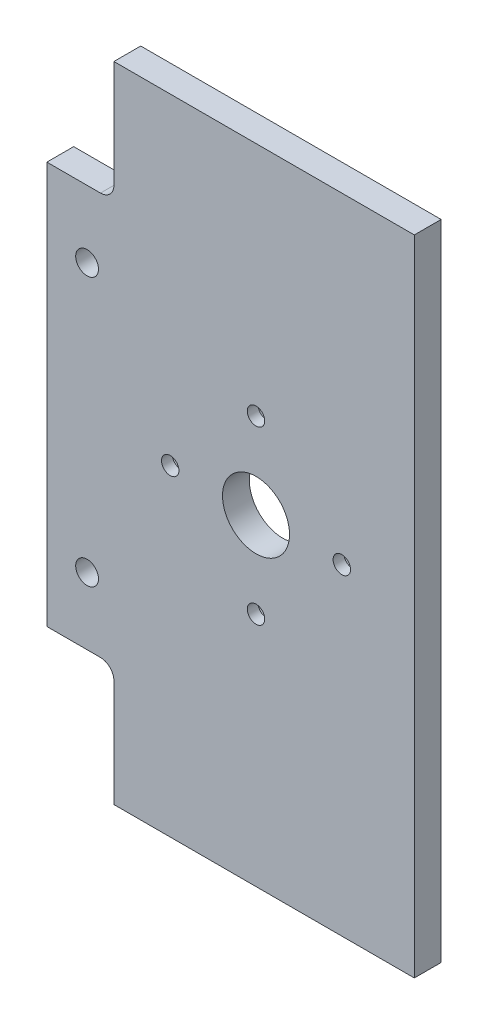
from build123d import *

# Parameters (mm, degrees)
ESQUISSE1_R                  = 12.5
ESQUISSE1_R_2                = 4
BASE_EXTRUSION_DEPTH         = 10
ESQUISSE2_R                  = 3.25
ENL_V_MAT_EXTRU_1_DEPTH      = 144.471251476
ESQUISSE3_R                  = 6.5
ENL_V_MAT_EXTRU_2_DEPTH      = 6
R_P_TITION_CIRCULAIRE1_COUNT = 4
ESQUISSE4_R                  = 4.25
ESQUISSE4_R_2                = 10
ENL_V_MAT_EXTRU_3_DEPTH      = 144.471251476


with BuildPart() as part:
    # Esquisse1 → Base-Extrusion (new body)
    with BuildSketch(Plane.XY):
        with BuildLine():
            Line((-53, 120), (59.036427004, 120))
            Line((59.036427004, 120), (59.036427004, -120))
            Line((59.036427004, -120), (-53, -120))
            Line((-53, -120), (-53, -80))
            ThreePointArc((-53, -80), (-54.464466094, -76.464466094), (-58, -75))
            Line((-58, -75), (-78, -75))
            Line((-78, -75), (-78, 75))
            Line((-78, 75), (-58, 75))
            ThreePointArc((-58, 75), (-54.464466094, 76.464466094), (-53, 80))
            Line((-53, 80), (-53, 120))
        make_face()
        Circle(ESQUISSE1_R, mode=Mode.SUBTRACT)
        with Locations((-63, 50)):
            Circle(ESQUISSE1_R_2, mode=Mode.SUBTRACT)
        with Locations((-63, -50)):
            Circle(ESQUISSE1_R_2, mode=Mode.SUBTRACT)
    extrude(amount=BASE_EXTRUSION_DEPTH)

    # Esquisse2 → Enl_v. mat.-Extru.1 (cut, through all)
    with BuildSketch(Plane.XY.offset(10)):
        with Locations((-32, 0)):
            Circle(ESQUISSE2_R)
    enl_v_mat_extru_1 = extrude(amount=-ENL_V_MAT_EXTRU_1_DEPTH, mode=Mode.SUBTRACT)

    # Esquisse3 → Enl_v. mat.-Extru.2 (cut)
    with BuildSketch(Plane(origin=(0, 0, 0), x_dir=(-1, 0, 0), z_dir=(0, 0, -1))):
        with Locations((32, 0)):
            Circle(ESQUISSE3_R)
    enl_v_mat_extru_2 = extrude(amount=-ENL_V_MAT_EXTRU_2_DEPTH, mode=Mode.SUBTRACT)

    # R_p_tition circulaire1: Enl_v. mat.-Extru.1, Enl_v. mat.-Extru.2 ×4 about axis
    r_p_tition_circulaire1_axis = Axis((0, 0, 0), (0, 0, 1))
    add([enl_v_mat_extru_1.rotate(r_p_tition_circulaire1_axis, i * 360 / R_P_TITION_CIRCULAIRE1_COUNT) for i in range(1, R_P_TITION_CIRCULAIRE1_COUNT)], mode=Mode.SUBTRACT)
    add([enl_v_mat_extru_2.rotate(r_p_tition_circulaire1_axis, i * 360 / R_P_TITION_CIRCULAIRE1_COUNT) for i in range(1, R_P_TITION_CIRCULAIRE1_COUNT)], mode=Mode.SUBTRACT)

    # Esquisse4 → Enl_v. mat.-Extru.3 (cut, through all)
    with BuildSketch(Plane.XY.offset(10)):
        with Locations((-63, 50)):
            Circle(ESQUISSE4_R)
        with Locations((-63, -50)):
            Circle(ESQUISSE4_R)
        Circle(ESQUISSE4_R_2)
    extrude(amount=-ENL_V_MAT_EXTRU_3_DEPTH, mode=Mode.SUBTRACT)


solid = part.part
